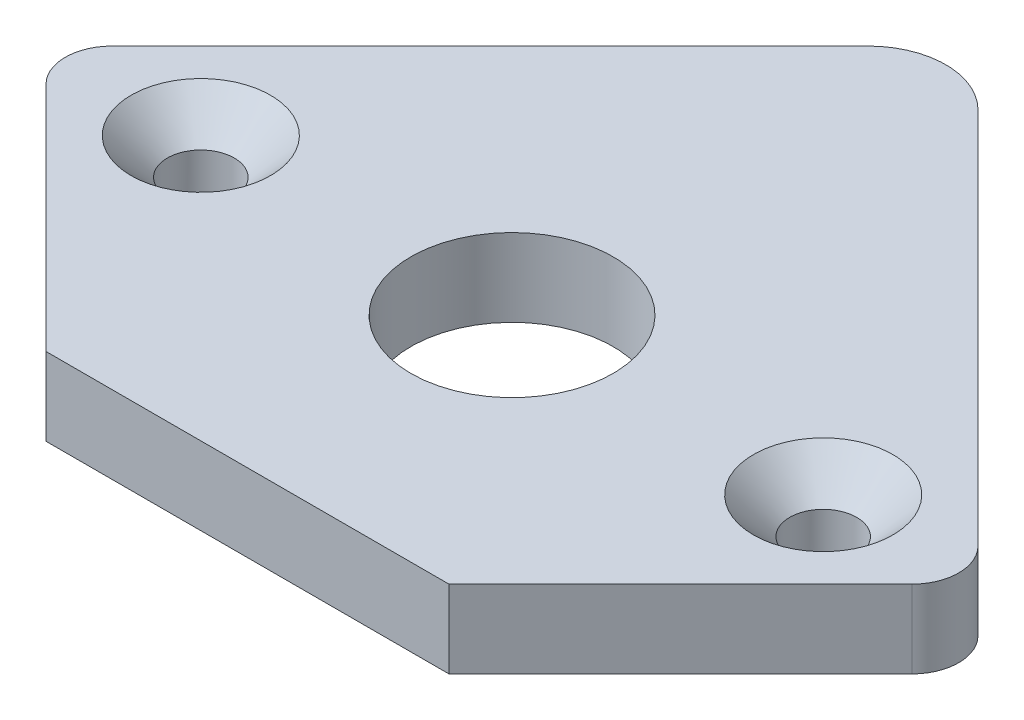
from build123d import *

# Parameters (mm, degrees)
SKETCH1_R                     = 6.5
BOSS_EXTRUDE1_DEPTH           = 2.5
CSK_FOR_M4_SFHCS1_D           = 4.3
CSK_FOR_M4_SFHCS1_DEPTH       = 11.5
CSK_FOR_M4_SFHCS1_CSINK_D     = 8.96
CSK_FOR_M4_SFHCS1_CSINK_ANGLE = 90
CSK_FOR_M4_SFHCS1_TIP         = 1.291850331


with BuildPart() as part:
    # Sketch1 → Boss-Extrude1 (new, symmetric)
    with BuildSketch(Plane(origin=(0, 0, 0), x_dir=(1, 0, 0), z_dir=(0, 1, 0))):
        with BuildLine():
            Line((12.95, -17), (-12.95, -17))
            Line((-12.95, -17), (-27.828679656, -2.121320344))
            ThreePointArc((-27.828679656, -2.121320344), (-28.707359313, 0), (-27.828679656, 2.121320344))
            Line((-27.828679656, 2.121320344), (-3.535533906, 26.414466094))
            ThreePointArc((-3.535533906, 26.414466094), (0, 27.878932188), (3.535533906, 26.414466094))
            Line((3.535533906, 26.414466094), (27.828679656, 2.121320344))
            ThreePointArc((27.828679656, 2.121320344), (28.707359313, 0), (27.828679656, -2.121320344))
            Line((27.828679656, -2.121320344), (12.95, -17))
        make_face()
        with Locations(Location((0, 0, 0), (0, 0, 270))):
            Circle(SKETCH1_R, mode=Mode.SUBTRACT)
    extrude(amount=BOSS_EXTRUDE1_DEPTH, both=True)

    # CSK for M4 SFHCS1
    with Locations(Plane(origin=(0, 2.5, 0), x_dir=(1, 0, 0), z_dir=(0, 1, 0))):
        with Locations((20, 0), (-20, 0)):
            CounterSinkHole(CSK_FOR_M4_SFHCS1_D / 2, CSK_FOR_M4_SFHCS1_CSINK_D / 2, depth=CSK_FOR_M4_SFHCS1_DEPTH, counter_sink_angle=CSK_FOR_M4_SFHCS1_CSINK_ANGLE)
            with Locations((0, 0, -(CSK_FOR_M4_SFHCS1_DEPTH + CSK_FOR_M4_SFHCS1_TIP / 2))):  # 118° drill point
                Cone(0, CSK_FOR_M4_SFHCS1_D / 2, CSK_FOR_M4_SFHCS1_TIP, mode=Mode.SUBTRACT)


solid = part.part
